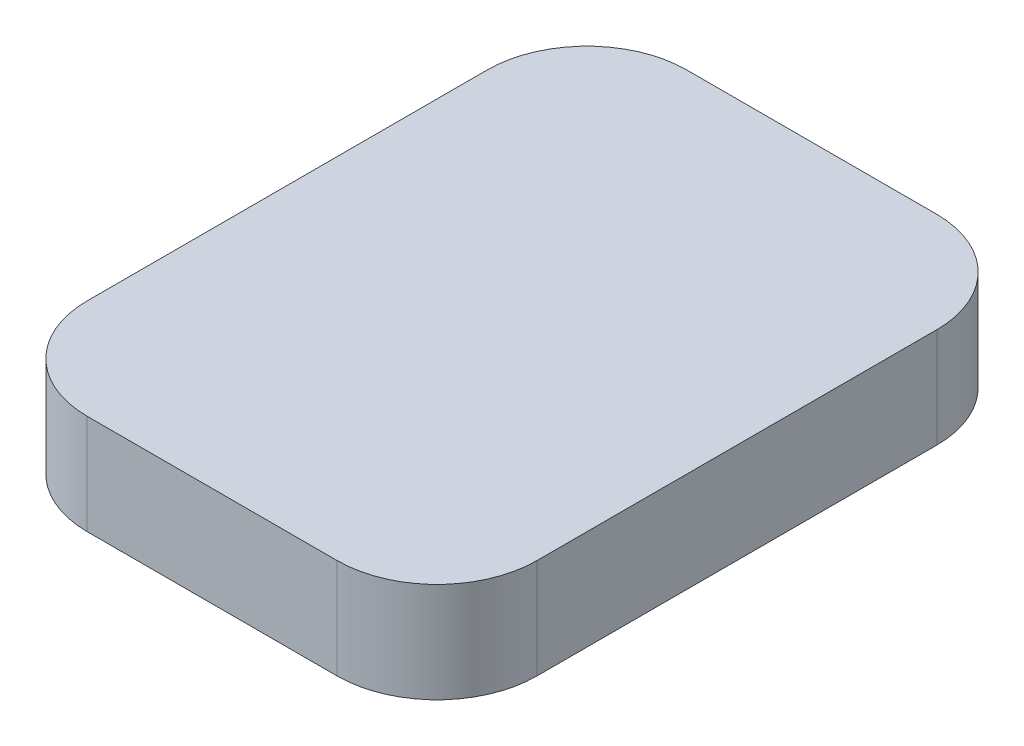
from build123d import *

# Parameters (mm, degrees)
EXTRUDE_1_DEPTH = 2


with BuildPart() as part:
    # Sketch 1 → Extrude 1 (new body)
    with BuildSketch(Plane(origin=(0, 0, 0), x_dir=(1, 0, 0), z_dir=(0, 1, 0))):
        with BuildLine():
            Line((-11.517192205, 0.080148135), (-16.517192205, 0.080148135))
            ThreePointArc((-16.517192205, 0.080148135), (-17.931405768, 0.665934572), (-18.517192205, 2.080148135))
            Line((-18.517192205, 2.080148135), (-18.517192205, 10.080148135))
            ThreePointArc((-18.517192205, 10.080148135), (-17.931405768, 11.494361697), (-16.517192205, 12.080148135))
            Line((-16.517192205, 12.080148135), (-11.517192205, 12.080148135))
            ThreePointArc((-11.517192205, 12.080148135), (-10.102978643, 11.494361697), (-9.517192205, 10.080148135))
            Line((-9.517192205, 10.080148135), (-9.517192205, 2.080148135))
            ThreePointArc((-9.517192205, 2.080148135), (-10.102978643, 0.665934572), (-11.517192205, 0.080148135))
        make_face()
    extrude(amount=EXTRUDE_1_DEPTH)


solid = part.part
